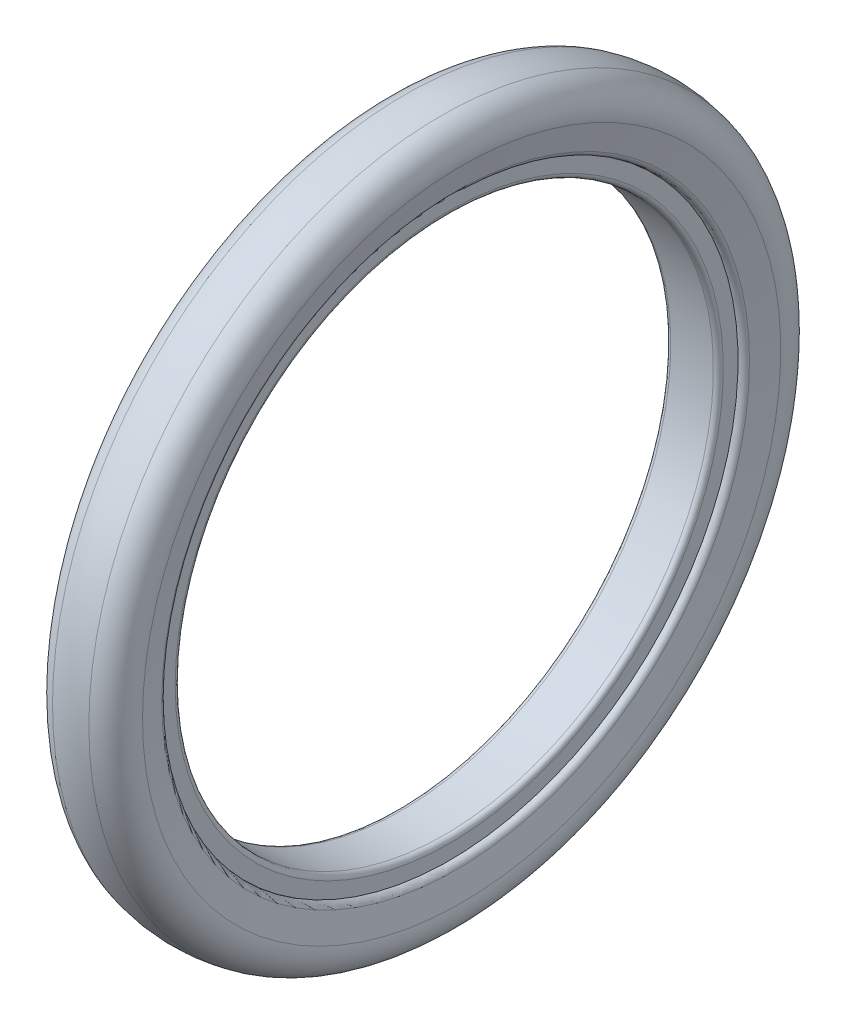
from build123d import *


with BuildPart() as part:
    # Sketch1 → Revolve2 (revolve)
    with BuildSketch(Plane.XY, mode=Mode.PRIVATE) as revolve2_sk:
        with BuildLine():
            Line((-25.4, 279.4), (-25.4, 265.1252))
            ThreePointArc((-25.4, 265.1252), (-24.001376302, 261.748623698), (-20.6248, 260.35))
            Line((-20.6248, 260.35), (20.6248, 260.35))
            ThreePointArc((20.6248, 260.35), (24.001376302, 261.748623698), (25.4, 265.1252))
            Line((25.4, 265.1252), (25.4, 279.4))
            Line((25.4, 279.4), (-25.4, 279.4))
        make_face()
    revolve(revolve2_sk.sketch.rotate(Axis((0, 0, 0), (1, 0, 0)), 90), axis=Axis((0, 0, 0), (1, 0, 0)))


with BuildPart() as body_2:
    # Sketch1_3 → Revolve3 (revolve)
    with BuildSketch(Plane.XY, mode=Mode.PRIVATE) as revolve3_sk:
        with BuildLine():
            ThreePointArc((31.578502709, 284.284188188), (29.337930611, 280.768514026), (25.4, 279.4))
            Line((25.4, 279.4), (-25.4, 279.4))
            ThreePointArc((-25.4, 279.4), (-29.337930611, 280.768514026), (-31.578502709, 284.284188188))
            Line((-31.578502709, 284.284188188), (-37.37971138, 308.736701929))
            ThreePointArc((-37.37971138, 308.736701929), (-34.131972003, 328.88987428), (-17.584615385, 340.843248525))
            ThreePointArc((-17.584615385, 340.843248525), (0, 342.9), (17.584615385, 340.843248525))
            ThreePointArc((17.584615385, 340.843248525), (34.131972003, 328.88987428), (37.37971138, 308.736701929))
            Line((37.37971138, 308.736701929), (31.578502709, 284.284188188))
        make_face()
    revolve(revolve3_sk.sketch.rotate(Axis((0, 0, 0), (1, 0, 0)), 90), axis=Axis((0, 0, 0), (1, 0, 0)))


solid = Compound([part.part, body_2.part])
